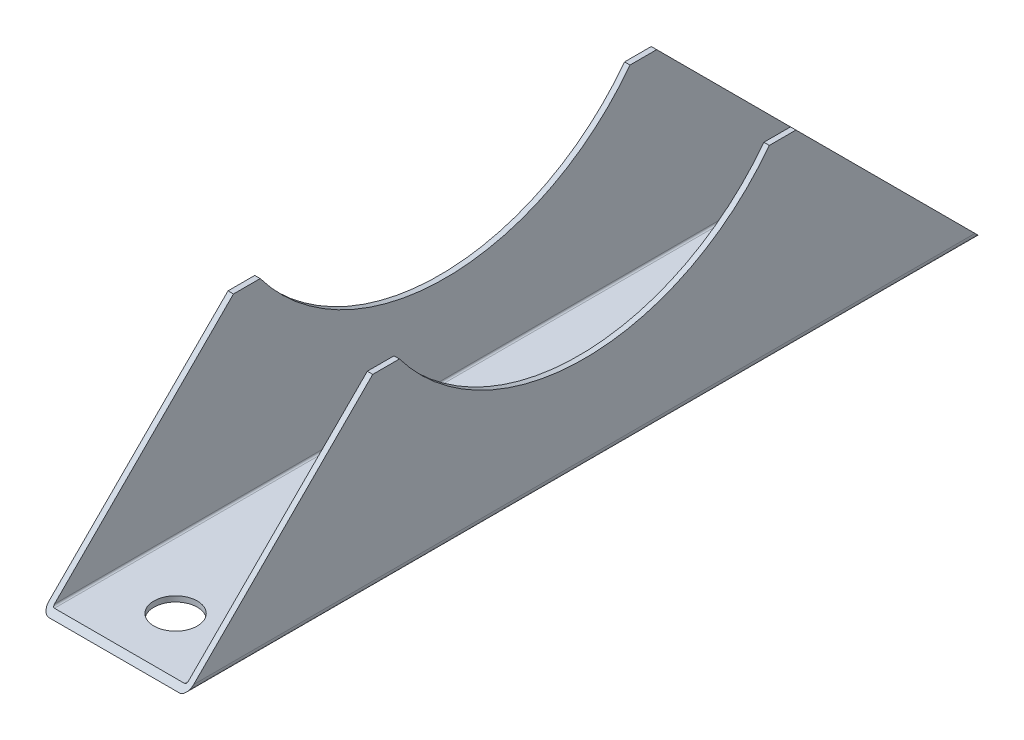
from build123d import *

# Parameters (mm, degrees)
EXTRUSION1_DEPTH = 110
EXTRUSION2_DEPTH = 128.875916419
EXTRUSION3_REACH = 124.474
ESQUISSE3_R      = 6
EXTRUSION4_DEPTH = 128.875916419
CONG_1_R         = 0.5
CONG_2_R         = 2


with BuildPart() as part:
    # Esquisse1 → Extrusion1 (new, symmetric)
    with BuildSketch(Plane.XY):
        Polygon((-20, 0), (-20, 51.5), (-18.5, 51.5), (-18.5, 1.5), (18.5, 1.5), (18.5, 51.5), (20, 51.5), (20, 0), align=None)
    extrude(amount=EXTRUSION1_DEPTH, both=True)

    # Esquisse2 → Extrusion2 (cut, through all)
    with BuildSketch(Plane(origin=(20, 0, 0), x_dir=(0, 0, -1), z_dir=(1, 0, 0))):
        Polygon((-110, 51.5), (-58.5, 51.5), (-110, 0), align=None)
    extrusion2 = extrude(amount=-EXTRUSION2_DEPTH, mode=Mode.SUBTRACT)

    # Esquisse3 → Extrusion3 (cut, up to next)
    with BuildSketch(Plane(origin=(0, 1.5, 0), x_dir=(1, 0, 0), z_dir=(0, 1, 0)), mode=Mode.PRIVATE) as extrusion3_sk1:
        with Locations(Location((0, -93, 0), (0, 0, 180))):
            Circle(ESQUISSE3_R)
    extrusion3_tool1 = extrude(extrusion3_sk1.sketch, amount=-EXTRUSION3_REACH, mode=Mode.PRIVATE) & part.part
    extrusion3 = extrusion3_tool1.solids().sort_by_distance((0, 1.5, 93))[0]
    add(extrusion3, mode=Mode.SUBTRACT)

    # Sym_trie1: Extrusion2, Extrusion3 across plane
    add(extrusion2.mirror(Plane.XY), mode=Mode.SUBTRACT)
    add(extrusion3.mirror(Plane.XY), mode=Mode.SUBTRACT)

    # Esquisse4 → Extrusion4 (cut, through all)
    with BuildSketch(Plane(origin=(20, 0, 0), x_dir=(0, 0, -1), z_dir=(1, 0, 0))):
        with BuildLine():
            Line((-51.124847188, 51.5), (51.124847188, 51.5))
            ThreePointArc((51.124847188, 51.5), (0, 26), (-51.124847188, 51.5))
        make_face()
    extrude(amount=-EXTRUSION4_DEPTH, mode=Mode.SUBTRACT)

    # Cong_1
    cong_1_edges = [part.edges().sort_by_distance(p)[0] for p in [
        (-18.5, 1.5, 0),
        (18.5, 1.5, 0),
    ]]
    fillet(cong_1_edges, radius=CONG_1_R)

    # Cong_2
    cong_2_edges = [part.edges().sort_by_distance(p)[0] for p in [
        (-20, 0, 0),
        (20, 0, 0),
    ]]
    fillet(cong_2_edges, radius=CONG_2_R)


solid = part.part
